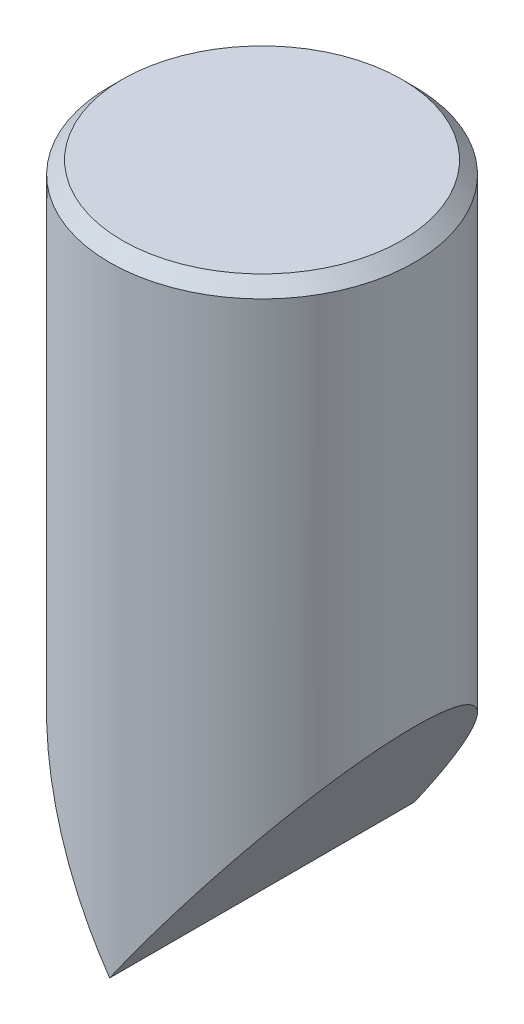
ISO-10303-21;
HEADER;
FILE_DESCRIPTION(('STEP AP214'),'2;1');
FILE_NAME('part.step','',(''),(''),'','','');
FILE_SCHEMA(('AUTOMOTIVE_DESIGN { 1 0 10303 214 1 1 1 1 }'));
ENDSEC;
DATA;
#1=APPLICATION_CONTEXT('core data for automotive mechanical design processes');
#2=APPLICATION_PROTOCOL_DEFINITION('international standard','automotive_design',2000,#1);
#3=PRODUCT_CONTEXT('',#1,'mechanical');
#4=PRODUCT('Part','Part','',(#3));
#5=PRODUCT_RELATED_PRODUCT_CATEGORY('part','',(#4));
#6=PRODUCT_DEFINITION_FORMATION('','',#4);
#7=PRODUCT_DEFINITION_CONTEXT('part definition',#1,'design');
#8=PRODUCT_DEFINITION('design','',#6,#7);
#9=PRODUCT_DEFINITION_SHAPE('','',#8);
#10=(LENGTH_UNIT() NAMED_UNIT(*) SI_UNIT(.MILLI.,.METRE.));
#11=(NAMED_UNIT(*) PLANE_ANGLE_UNIT() SI_UNIT($,.RADIAN.));
#12=(NAMED_UNIT(*) SI_UNIT($,.STERADIAN.) SOLID_ANGLE_UNIT());
#13=UNCERTAINTY_MEASURE_WITH_UNIT(LENGTH_MEASURE(1.E-05),#10,'distance_accuracy_value','');
#14=(GEOMETRIC_REPRESENTATION_CONTEXT(3) GLOBAL_UNCERTAINTY_ASSIGNED_CONTEXT((#13)) GLOBAL_UNIT_ASSIGNED_CONTEXT((#10,
#11,#12)) REPRESENTATION_CONTEXT('',''));
#15=CARTESIAN_POINT('',(0.,0.,0.));
#16=DIRECTION('',(0.,0.,1.));
#17=DIRECTION('',(1.,0.,0.));
#18=AXIS2_PLACEMENT_3D('',#15,#16,#17);
#19=CARTESIAN_POINT('',(0.,12.45,0.));
#20=DIRECTION('',(0.,-1.,0.));
#21=DIRECTION('',(0.,0.,-1.));
#22=AXIS2_PLACEMENT_3D('',#19,#20,#21);
#23=CYLINDRICAL_SURFACE('',#22,3.);
#24=CARTESIAN_POINT('',(0.,12.2,0.));
#25=DIRECTION('',(0.,1.,0.));
#26=DIRECTION('',(0.,0.,1.));
#27=AXIS2_PLACEMENT_3D('',#24,#25,#26);
#28=CIRCLE('',#27,3.);
#29=CARTESIAN_POINT('',(0.,12.2,3.));
#30=VERTEX_POINT('',#29);
#31=EDGE_CURVE('E11',#30,#30,#28,.F.);
#32=ORIENTED_EDGE('',*,*,#31,.T.);
#33=EDGE_LOOP('',(#32));
#34=FACE_BOUND('',#33,.T.);
#35=CARTESIAN_POINT('',(0.,0.,0.));
#36=DIRECTION('',(0.819152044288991,0.573576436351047,0.));
#37=DIRECTION('',(0.573576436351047,-0.819152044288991,0.));
#38=AXIS2_PLACEMENT_3D('',#35,#36,#37);
#39=ELLIPSE('',#38,5.23034038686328,3.);
#40=CARTESIAN_POINT('',(0.,0.,-3.));
#41=VERTEX_POINT('',#40);
#42=CARTESIAN_POINT('',(0.,0.,3.));
#43=VERTEX_POINT('',#42);
#44=EDGE_CURVE('E45',#41,#43,#39,.T.);
#45=ORIENTED_EDGE('',*,*,#44,.T.);
#46=CARTESIAN_POINT('',(0.,0.,0.));
#47=DIRECTION('',(-0.819152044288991,0.573576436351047,0.));
#48=DIRECTION('',(-0.573576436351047,-0.819152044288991,0.));
#49=AXIS2_PLACEMENT_3D('',#46,#47,#48);
#50=ELLIPSE('',#49,5.23034038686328,3.);
#51=EDGE_CURVE('E48',#43,#41,#50,.T.);
#52=ORIENTED_EDGE('',*,*,#51,.T.);
#53=EDGE_LOOP('',(#45,#52));
#54=FACE_BOUND('',#53,.T.);
#55=ADVANCED_FACE('F31',(#34,#54),#23,.T.);
#56=CARTESIAN_POINT('',(0.,12.45,0.));
#57=DIRECTION('',(0.,1.,0.));
#58=DIRECTION('',(0.,0.,1.));
#59=AXIS2_PLACEMENT_3D('',#56,#57,#58);
#60=PLANE('',#59);
#61=CARTESIAN_POINT('',(0.,12.45,0.));
#62=DIRECTION('',(0.,1.,0.));
#63=DIRECTION('',(0.,0.,1.));
#64=AXIS2_PLACEMENT_3D('',#61,#62,#63);
#65=CIRCLE('',#64,2.75);
#66=CARTESIAN_POINT('',(0.,12.45,2.75));
#67=VERTEX_POINT('',#66);
#68=EDGE_CURVE('E39',#67,#67,#65,.T.);
#69=ORIENTED_EDGE('',*,*,#68,.T.);
#70=EDGE_LOOP('',(#69));
#71=FACE_BOUND('',#70,.T.);
#72=ADVANCED_FACE('F61',(#71),#60,.T.);
#73=CARTESIAN_POINT('',(0.,0.,-3.5));
#74=DIRECTION('',(-0.819152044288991,0.573576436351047,0.));
#75=DIRECTION('',(-0.573576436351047,-0.819152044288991,0.));
#76=AXIS2_PLACEMENT_3D('',#73,#74,#75);
#77=PLANE('',#76);
#78=DIRECTION('',(0.,0.,1.));
#79=VECTOR('',#78,1.);
#80=CARTESIAN_POINT('',(0.,0.,-3.5));
#81=LINE('',#80,#79);
#82=EDGE_CURVE('E54',#41,#43,#81,.T.);
#83=ORIENTED_EDGE('',*,*,#82,.F.);
#84=ORIENTED_EDGE('',*,*,#51,.F.);
#85=EDGE_LOOP('',(#83,#84));
#86=FACE_BOUND('',#85,.T.);
#87=ADVANCED_FACE('F56',(#86),#77,.F.);
#88=CARTESIAN_POINT('',(0.,0.,-3.5));
#89=DIRECTION('',(0.819152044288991,0.573576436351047,0.));
#90=DIRECTION('',(-0.573576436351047,0.819152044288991,0.));
#91=AXIS2_PLACEMENT_3D('',#88,#89,#90);
#92=PLANE('',#91);
#93=ORIENTED_EDGE('',*,*,#82,.T.);
#94=ORIENTED_EDGE('',*,*,#44,.F.);
#95=EDGE_LOOP('',(#93,#94));
#96=FACE_BOUND('',#95,.T.);
#97=ADVANCED_FACE('F53',(#96),#92,.F.);
#98=CARTESIAN_POINT('',(0.,12.45,0.));
#99=DIRECTION('',(0.,-1.,0.));
#100=DIRECTION('',(0.,0.,-1.));
#101=AXIS2_PLACEMENT_3D('',#98,#99,#100);
#102=CONICAL_SURFACE('',#101,2.75,0.785398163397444);
#103=ORIENTED_EDGE('',*,*,#31,.F.);
#104=EDGE_LOOP('',(#103));
#105=FACE_BOUND('',#104,.T.);
#106=ORIENTED_EDGE('',*,*,#68,.F.);
#107=EDGE_LOOP('',(#106));
#108=FACE_BOUND('',#107,.T.);
#109=ADVANCED_FACE('F33',(#105,#108),#102,.T.);
#110=CLOSED_SHELL('',(#55,#72,#87,#97,#109));
#111=MANIFOLD_SOLID_BREP('B2',#110);
#112=ADVANCED_BREP_SHAPE_REPRESENTATION('',(#18,#111),#14);
#113=SHAPE_DEFINITION_REPRESENTATION(#9,#112);
ENDSEC;
END-ISO-10303-21;
